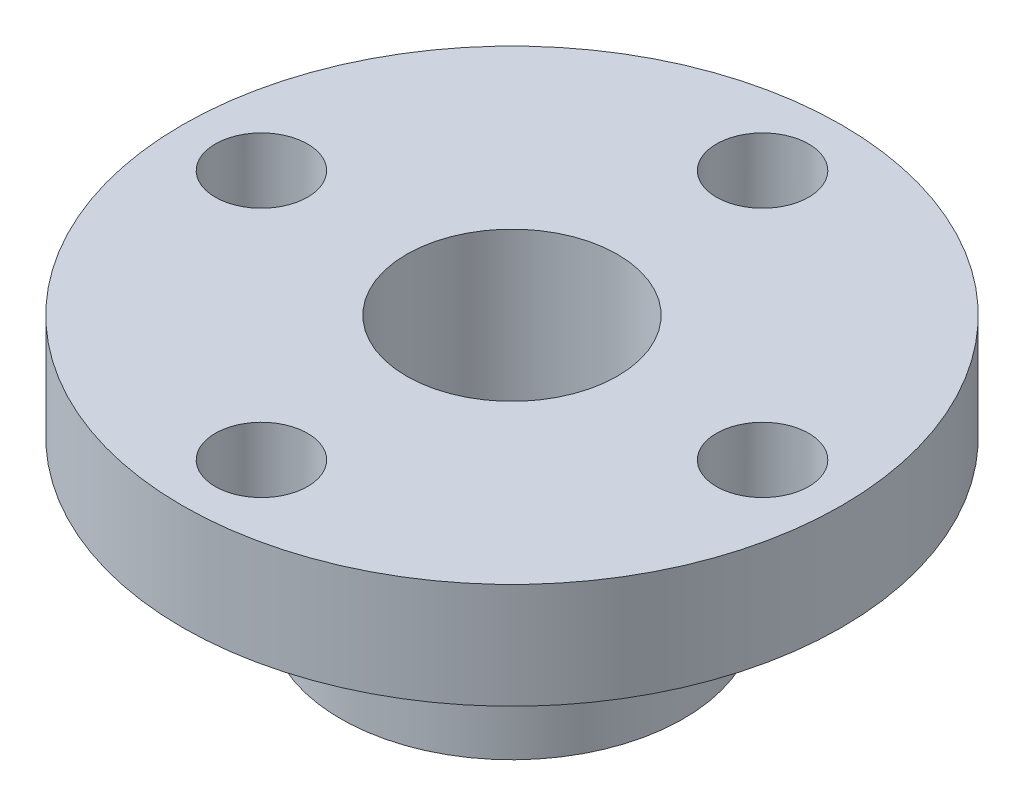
from build123d import *

# Parameters (mm, degrees)
SKETCH2_R          = 4
SKETCH2_R_2        = 1.75
CUT_EXTRUDE1_DEPTH = 21.310096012


with BuildPart() as part:
    # Sketch1 → Revolve1 (revolve)
    with BuildSketch(Plane.XY, mode=Mode.PRIVATE) as revolve1_sk:
        Polygon((0, 0), (12.5, 0), (12.5, -4), (6.5, -4), (6.5, -10), (0, -10), align=None)
    revolve(revolve1_sk.sketch.rotate(Axis((0, -10, 0), (0, 1, 0)), 90), axis=Axis((0, -10, 0), (0, 1, 0)))

    # Sketch2 → Cut-Extrude1 (cut, through all)
    with BuildSketch(Plane(origin=(0, 0, 0), x_dir=(1, 0, 0), z_dir=(0, 1, 0))):
        with Locations(Location((0, 0, 0), (0, 0, 270))):
            Circle(SKETCH2_R)
        with Locations(Location((0, 9.5, 0), (0, 0, 270))):
            Circle(SKETCH2_R_2)
        with Locations(Location((9.5, 0, 0), (0, 0, 270))):
            Circle(SKETCH2_R_2)
        with Locations(Location((0, -9.5, 0), (0, 0, 270))):
            Circle(SKETCH2_R_2)
        with Locations(Location((-9.5, 0, 0), (0, 0, 270))):
            Circle(SKETCH2_R_2)
    extrude(amount=-CUT_EXTRUDE1_DEPTH, mode=Mode.SUBTRACT)


solid = part.part
